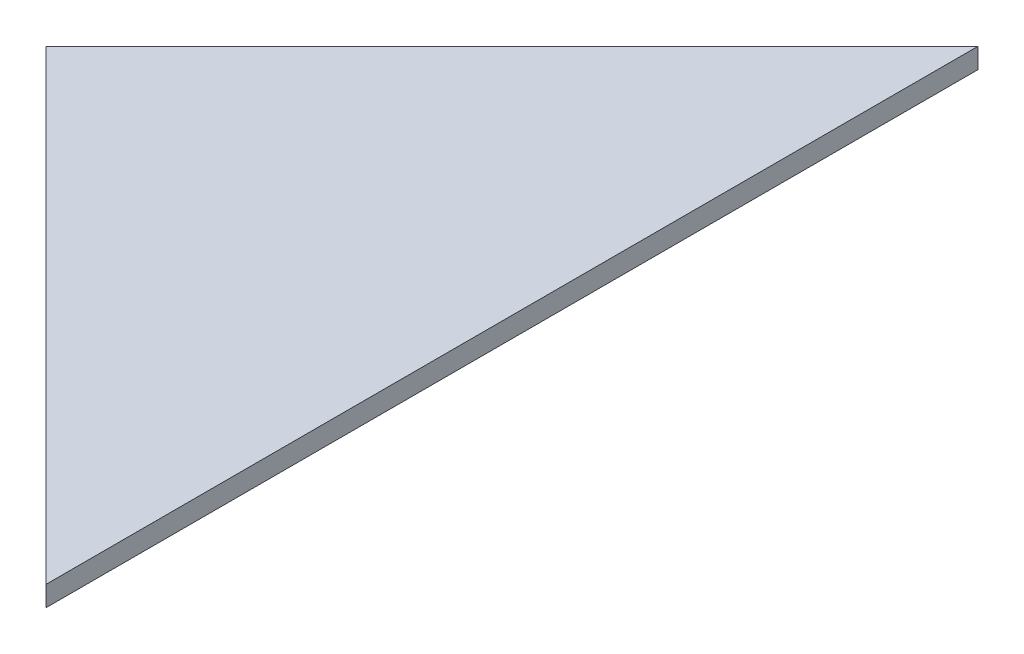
ISO-10303-21;
HEADER;
FILE_DESCRIPTION(('STEP AP214'),'2;1');
FILE_NAME('part.step','',(''),(''),'','','');
FILE_SCHEMA(('AUTOMOTIVE_DESIGN { 1 0 10303 214 1 1 1 1 }'));
ENDSEC;
DATA;
#1=APPLICATION_CONTEXT('core data for automotive mechanical design processes');
#2=APPLICATION_PROTOCOL_DEFINITION('international standard','automotive_design',2000,#1);
#3=PRODUCT_CONTEXT('',#1,'mechanical');
#4=PRODUCT('Part','Part','',(#3));
#5=PRODUCT_RELATED_PRODUCT_CATEGORY('part','',(#4));
#6=PRODUCT_DEFINITION_FORMATION('','',#4);
#7=PRODUCT_DEFINITION_CONTEXT('part definition',#1,'design');
#8=PRODUCT_DEFINITION('design','',#6,#7);
#9=PRODUCT_DEFINITION_SHAPE('','',#8);
#10=(LENGTH_UNIT() NAMED_UNIT(*) SI_UNIT(.MILLI.,.METRE.));
#11=(NAMED_UNIT(*) PLANE_ANGLE_UNIT() SI_UNIT($,.RADIAN.));
#12=(NAMED_UNIT(*) SI_UNIT($,.STERADIAN.) SOLID_ANGLE_UNIT());
#13=UNCERTAINTY_MEASURE_WITH_UNIT(LENGTH_MEASURE(1.E-05),#10,'distance_accuracy_value','');
#14=(GEOMETRIC_REPRESENTATION_CONTEXT(3) GLOBAL_UNCERTAINTY_ASSIGNED_CONTEXT((#13)) GLOBAL_UNIT_ASSIGNED_CONTEXT((#10,
#11,#12)) REPRESENTATION_CONTEXT('',''));
#15=CARTESIAN_POINT('',(0.,0.,0.));
#16=DIRECTION('',(0.,0.,1.));
#17=DIRECTION('',(1.,0.,0.));
#18=AXIS2_PLACEMENT_3D('',#15,#16,#17);
#19=CARTESIAN_POINT('',(-51.7500000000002,1.,-51.750000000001));
#20=DIRECTION('',(-0.707106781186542,0.,-0.707106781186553));
#21=DIRECTION('',(-0.707106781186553,0.,0.707106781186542));
#22=AXIS2_PLACEMENT_3D('',#19,#20,#21);
#23=PLANE('',#22);
#24=DIRECTION('',(0.707106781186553,0.,-0.707106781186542));
#25=VECTOR('',#24,1.);
#26=CARTESIAN_POINT('',(-51.7500000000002,0.,-51.750000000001));
#27=LINE('',#26,#25);
#28=CARTESIAN_POINT('',(0.,0.,-103.5));
#29=VERTEX_POINT('',#28);
#30=CARTESIAN_POINT('',(23.,0.,-126.5));
#31=VERTEX_POINT('',#30);
#32=EDGE_CURVE('E71',#29,#31,#27,.T.);
#33=ORIENTED_EDGE('',*,*,#32,.F.);
#34=DIRECTION('',(0.,-1.,0.));
#35=VECTOR('',#34,1.);
#36=CARTESIAN_POINT('',(0.,1.,-103.5));
#37=LINE('',#36,#35);
#38=CARTESIAN_POINT('',(0.,1.,-103.5));
#39=VERTEX_POINT('',#38);
#40=EDGE_CURVE('E11',#39,#29,#37,.T.);
#41=ORIENTED_EDGE('',*,*,#40,.F.);
#42=DIRECTION('',(0.707106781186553,0.,-0.707106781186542));
#43=VECTOR('',#42,1.);
#44=CARTESIAN_POINT('',(-51.7500000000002,1.,-51.750000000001));
#45=LINE('',#44,#43);
#46=CARTESIAN_POINT('',(23.,1.,-126.5));
#47=VERTEX_POINT('',#46);
#48=EDGE_CURVE('E69',#39,#47,#45,.T.);
#49=ORIENTED_EDGE('',*,*,#48,.T.);
#50=DIRECTION('',(0.,-1.,0.));
#51=VECTOR('',#50,1.);
#52=CARTESIAN_POINT('',(23.,1.,-126.5));
#53=LINE('',#52,#51);
#54=EDGE_CURVE('E67',#47,#31,#53,.T.);
#55=ORIENTED_EDGE('',*,*,#54,.T.);
#56=EDGE_LOOP('',(#33,#41,#49,#55));
#57=FACE_BOUND('',#56,.T.);
#58=ADVANCED_FACE('F34',(#57),#23,.T.);
#59=CARTESIAN_POINT('',(51.7500000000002,1.,-51.7499999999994));
#60=DIRECTION('',(-0.707106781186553,0.,0.707106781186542));
#61=DIRECTION('',(0.707106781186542,0.,0.707106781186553));
#62=AXIS2_PLACEMENT_3D('',#59,#60,#61);
#63=PLANE('',#62);
#64=DIRECTION('',(-0.707106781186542,0.,-0.707106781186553));
#65=VECTOR('',#64,1.);
#66=CARTESIAN_POINT('',(51.7500000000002,0.,-51.7499999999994));
#67=LINE('',#66,#65);
#68=CARTESIAN_POINT('',(23.,0.,-80.5));
#69=VERTEX_POINT('',#68);
#70=EDGE_CURVE('E85',#69,#29,#67,.T.);
#71=ORIENTED_EDGE('',*,*,#70,.F.);
#72=DIRECTION('',(0.,-1.,0.));
#73=VECTOR('',#72,1.);
#74=CARTESIAN_POINT('',(23.,1.,-80.5));
#75=LINE('',#74,#73);
#76=CARTESIAN_POINT('',(23.,1.,-80.5));
#77=VERTEX_POINT('',#76);
#78=EDGE_CURVE('E42',#77,#69,#75,.T.);
#79=ORIENTED_EDGE('',*,*,#78,.F.);
#80=DIRECTION('',(-0.707106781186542,0.,-0.707106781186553));
#81=VECTOR('',#80,1.);
#82=CARTESIAN_POINT('',(51.7500000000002,1.,-51.7499999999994));
#83=LINE('',#82,#81);
#84=EDGE_CURVE('E77',#77,#39,#83,.T.);
#85=ORIENTED_EDGE('',*,*,#84,.T.);
#86=ORIENTED_EDGE('',*,*,#40,.T.);
#87=EDGE_LOOP('',(#71,#79,#85,#86));
#88=FACE_BOUND('',#87,.T.);
#89=ADVANCED_FACE('F80',(#88),#63,.T.);
#90=CARTESIAN_POINT('',(23.,1.,0.));
#91=DIRECTION('',(-1.,0.,0.));
#92=DIRECTION('',(0.,0.,1.));
#93=AXIS2_PLACEMENT_3D('',#90,#91,#92);
#94=PLANE('',#93);
#95=DIRECTION('',(0.,0.,-1.));
#96=VECTOR('',#95,1.);
#97=CARTESIAN_POINT('',(23.,0.,0.));
#98=LINE('',#97,#96);
#99=EDGE_CURVE('E78',#69,#31,#98,.T.);
#100=ORIENTED_EDGE('',*,*,#99,.T.);
#101=ORIENTED_EDGE('',*,*,#54,.F.);
#102=DIRECTION('',(0.,0.,-1.));
#103=VECTOR('',#102,1.);
#104=CARTESIAN_POINT('',(23.,1.,0.));
#105=LINE('',#104,#103);
#106=EDGE_CURVE('E50',#77,#47,#105,.T.);
#107=ORIENTED_EDGE('',*,*,#106,.F.);
#108=ORIENTED_EDGE('',*,*,#78,.T.);
#109=EDGE_LOOP('',(#100,#101,#107,#108));
#110=FACE_BOUND('',#109,.T.);
#111=ADVANCED_FACE('F88',(#110),#94,.F.);
#112=CARTESIAN_POINT('',(0.,1.,0.));
#113=DIRECTION('',(0.,1.,0.));
#114=DIRECTION('',(0.,0.,1.));
#115=AXIS2_PLACEMENT_3D('',#112,#113,#114);
#116=PLANE('',#115);
#117=ORIENTED_EDGE('',*,*,#48,.F.);
#118=ORIENTED_EDGE('',*,*,#84,.F.);
#119=ORIENTED_EDGE('',*,*,#106,.T.);
#120=EDGE_LOOP('',(#117,#118,#119));
#121=FACE_BOUND('',#120,.T.);
#122=ADVANCED_FACE('F76',(#121),#116,.T.);
#123=CARTESIAN_POINT('',(0.,0.,0.));
#124=DIRECTION('',(0.,1.,0.));
#125=DIRECTION('',(0.,0.,1.));
#126=AXIS2_PLACEMENT_3D('',#123,#124,#125);
#127=PLANE('',#126);
#128=ORIENTED_EDGE('',*,*,#32,.T.);
#129=ORIENTED_EDGE('',*,*,#99,.F.);
#130=ORIENTED_EDGE('',*,*,#70,.T.);
#131=EDGE_LOOP('',(#128,#129,#130));
#132=FACE_BOUND('',#131,.T.);
#133=ADVANCED_FACE('F90',(#132),#127,.F.);
#134=CLOSED_SHELL('',(#58,#89,#111,#122,#133));
#135=MANIFOLD_SOLID_BREP('B2',#134);
#136=ADVANCED_BREP_SHAPE_REPRESENTATION('',(#18,#135),#14);
#137=SHAPE_DEFINITION_REPRESENTATION(#9,#136);
ENDSEC;
END-ISO-10303-21;
